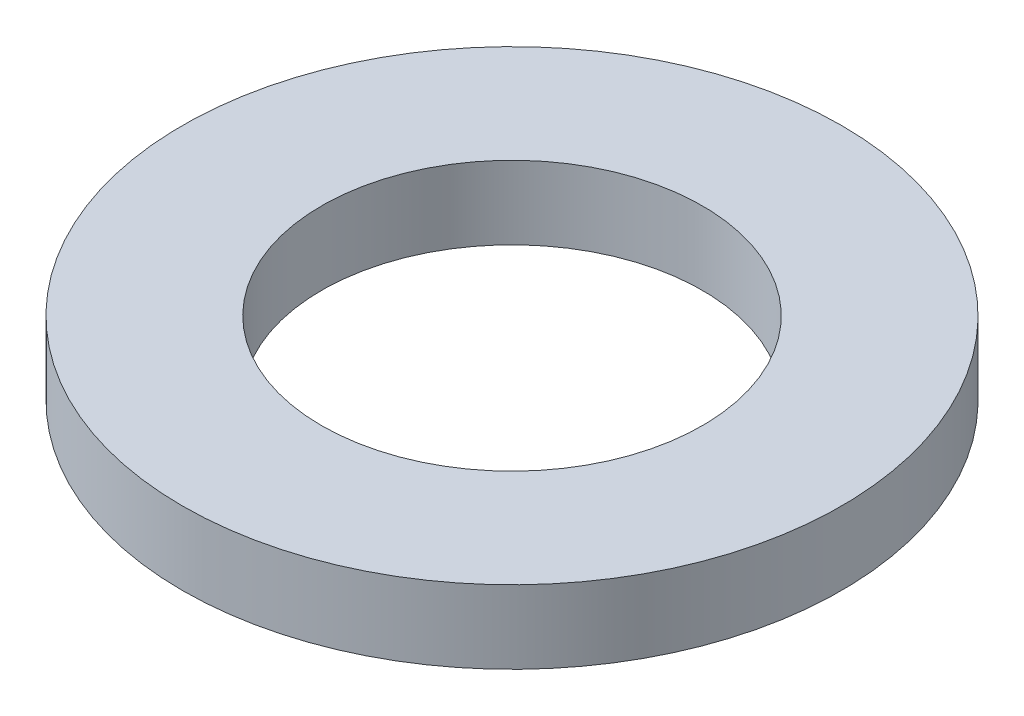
ISO-10303-21;
HEADER;
FILE_DESCRIPTION(('STEP AP214'),'2;1');
FILE_NAME('part.step','',(''),(''),'','','');
FILE_SCHEMA(('AUTOMOTIVE_DESIGN { 1 0 10303 214 1 1 1 1 }'));
ENDSEC;
DATA;
#1=APPLICATION_CONTEXT('core data for automotive mechanical design processes');
#2=APPLICATION_PROTOCOL_DEFINITION('international standard','automotive_design',2000,#1);
#3=PRODUCT_CONTEXT('',#1,'mechanical');
#4=PRODUCT('Part','Part','',(#3));
#5=PRODUCT_RELATED_PRODUCT_CATEGORY('part','',(#4));
#6=PRODUCT_DEFINITION_FORMATION('','',#4);
#7=PRODUCT_DEFINITION_CONTEXT('part definition',#1,'design');
#8=PRODUCT_DEFINITION('design','',#6,#7);
#9=PRODUCT_DEFINITION_SHAPE('','',#8);
#10=(LENGTH_UNIT() NAMED_UNIT(*) SI_UNIT(.MILLI.,.METRE.));
#11=(NAMED_UNIT(*) PLANE_ANGLE_UNIT() SI_UNIT($,.RADIAN.));
#12=(NAMED_UNIT(*) SI_UNIT($,.STERADIAN.) SOLID_ANGLE_UNIT());
#13=UNCERTAINTY_MEASURE_WITH_UNIT(LENGTH_MEASURE(1.E-05),#10,'distance_accuracy_value','');
#14=(GEOMETRIC_REPRESENTATION_CONTEXT(3) GLOBAL_UNCERTAINTY_ASSIGNED_CONTEXT((#13)) GLOBAL_UNIT_ASSIGNED_CONTEXT((#10,
#11,#12)) REPRESENTATION_CONTEXT('',''));
#15=CARTESIAN_POINT('',(0.,0.,0.));
#16=DIRECTION('',(0.,0.,1.));
#17=DIRECTION('',(1.,0.,0.));
#18=AXIS2_PLACEMENT_3D('',#15,#16,#17);
#19=CARTESIAN_POINT('',(0.,5.,0.));
#20=DIRECTION('',(0.,1.,0.));
#21=DIRECTION('',(0.,0.,1.));
#22=AXIS2_PLACEMENT_3D('',#19,#20,#21);
#23=PLANE('',#22);
#24=CARTESIAN_POINT('',(0.,5.,0.));
#25=DIRECTION('',(0.,1.,0.));
#26=DIRECTION('',(0.,0.,1.));
#27=AXIS2_PLACEMENT_3D('',#24,#25,#26);
#28=CIRCLE('',#27,22.5);
#29=CARTESIAN_POINT('',(0.,5.,22.5));
#30=VERTEX_POINT('',#29);
#31=EDGE_CURVE('E10',#30,#30,#28,.T.);
#32=ORIENTED_EDGE('',*,*,#31,.T.);
#33=EDGE_LOOP('',(#32));
#34=FACE_BOUND('',#33,.T.);
#35=CARTESIAN_POINT('',(0.,5.,0.));
#36=DIRECTION('',(0.,1.,0.));
#37=DIRECTION('',(0.,0.,1.));
#38=AXIS2_PLACEMENT_3D('',#35,#36,#37);
#39=CIRCLE('',#38,13.);
#40=CARTESIAN_POINT('',(0.,5.,13.));
#41=VERTEX_POINT('',#40);
#42=EDGE_CURVE('E40',#41,#41,#39,.T.);
#43=ORIENTED_EDGE('',*,*,#42,.F.);
#44=EDGE_LOOP('',(#43));
#45=FACE_BOUND('',#44,.T.);
#46=ADVANCED_FACE('F29',(#34,#45),#23,.T.);
#47=CARTESIAN_POINT('',(0.,0.,0.));
#48=DIRECTION('',(0.,1.,0.));
#49=DIRECTION('',(0.,0.,1.));
#50=AXIS2_PLACEMENT_3D('',#47,#48,#49);
#51=PLANE('',#50);
#52=CARTESIAN_POINT('',(0.,0.,0.));
#53=DIRECTION('',(0.,1.,0.));
#54=DIRECTION('',(0.,0.,1.));
#55=AXIS2_PLACEMENT_3D('',#52,#53,#54);
#56=CIRCLE('',#55,22.5);
#57=CARTESIAN_POINT('',(0.,0.,22.5));
#58=VERTEX_POINT('',#57);
#59=EDGE_CURVE('E33',#58,#58,#56,.T.);
#60=ORIENTED_EDGE('',*,*,#59,.F.);
#61=EDGE_LOOP('',(#60));
#62=FACE_BOUND('',#61,.T.);
#63=CARTESIAN_POINT('',(0.,0.,0.));
#64=DIRECTION('',(0.,1.,0.));
#65=DIRECTION('',(0.,0.,1.));
#66=AXIS2_PLACEMENT_3D('',#63,#64,#65);
#67=CIRCLE('',#66,13.);
#68=CARTESIAN_POINT('',(0.,0.,13.));
#69=VERTEX_POINT('',#68);
#70=EDGE_CURVE('E42',#69,#69,#67,.T.);
#71=ORIENTED_EDGE('',*,*,#70,.T.);
#72=EDGE_LOOP('',(#71));
#73=FACE_BOUND('',#72,.T.);
#74=ADVANCED_FACE('F52',(#62,#73),#51,.F.);
#75=CARTESIAN_POINT('',(0.,5.,0.));
#76=DIRECTION('',(0.,-1.,0.));
#77=DIRECTION('',(0.,0.,-1.));
#78=AXIS2_PLACEMENT_3D('',#75,#76,#77);
#79=CYLINDRICAL_SURFACE('',#78,22.5);
#80=ORIENTED_EDGE('',*,*,#31,.F.);
#81=EDGE_LOOP('',(#80));
#82=FACE_BOUND('',#81,.T.);
#83=ORIENTED_EDGE('',*,*,#59,.T.);
#84=EDGE_LOOP('',(#83));
#85=FACE_BOUND('',#84,.T.);
#86=ADVANCED_FACE('F31',(#82,#85),#79,.T.);
#87=CARTESIAN_POINT('',(0.,5.,0.));
#88=DIRECTION('',(0.,-1.,0.));
#89=DIRECTION('',(0.,0.,-1.));
#90=AXIS2_PLACEMENT_3D('',#87,#88,#89);
#91=CYLINDRICAL_SURFACE('',#90,13.);
#92=ORIENTED_EDGE('',*,*,#42,.T.);
#93=EDGE_LOOP('',(#92));
#94=FACE_BOUND('',#93,.T.);
#95=ORIENTED_EDGE('',*,*,#70,.F.);
#96=EDGE_LOOP('',(#95));
#97=FACE_BOUND('',#96,.T.);
#98=ADVANCED_FACE('F48',(#94,#97),#91,.F.);
#99=CLOSED_SHELL('',(#46,#74,#86,#98));
#100=MANIFOLD_SOLID_BREP('B2',#99);
#101=ADVANCED_BREP_SHAPE_REPRESENTATION('',(#18,#100),#14);
#102=SHAPE_DEFINITION_REPRESENTATION(#9,#101);
ENDSEC;
END-ISO-10303-21;
